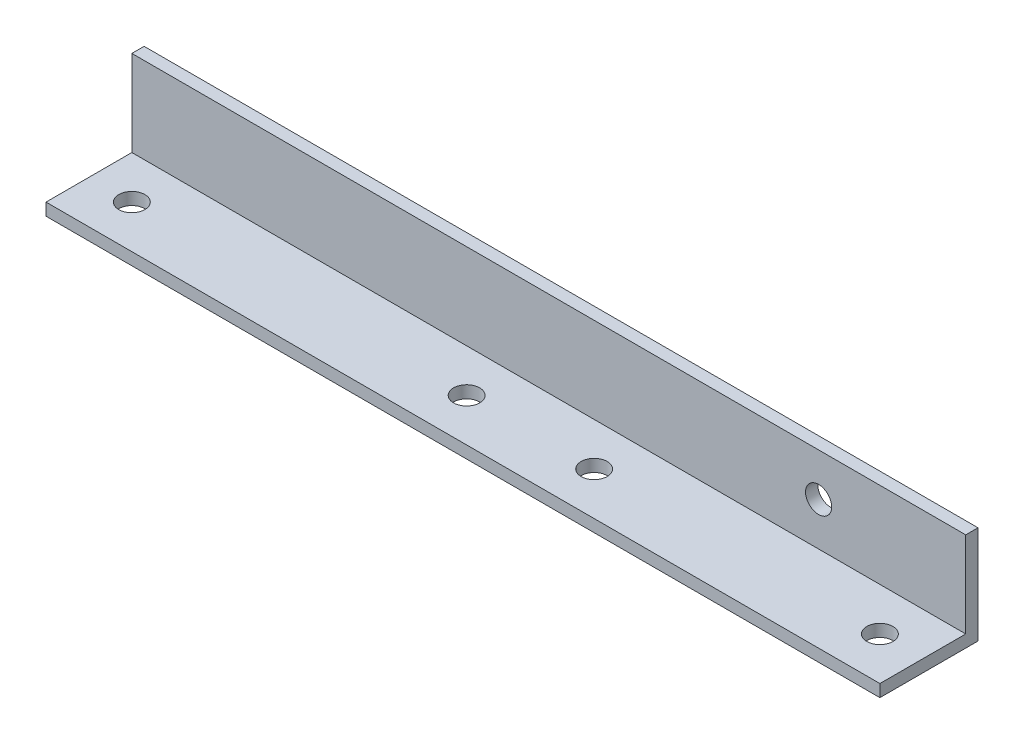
from build123d import *

# Parameters (mm, degrees)
SKETCH1_W           = 215.9
SKETCH1_H           = 25.4
BOSS_EXTRUDE1_DEPTH = 3.175
SKETCH2_W           = 215.9
SKETCH2_H           = 3.175
BOSS_EXTRUDE2_DEPTH = 22.225
SKETCH3_R           = 3.3782
CUT_EXTRUDE1_DEPTH  = 111.943423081
SKETCH4_R           = 3.3782
CUT_EXTRUDE2_DEPTH  = 114.103108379


with BuildPart() as part:
    # Sketch1 → Boss-Extrude1 (new body)
    with BuildSketch(Plane(origin=(0, 0, 0), x_dir=(1, 0, 0), z_dir=(0, 1, 0))):
        Rectangle(SKETCH1_W, SKETCH1_H)
    extrude(amount=BOSS_EXTRUDE1_DEPTH)

    # Sketch2 → Boss-Extrude2 (add)
    with BuildSketch(Plane(origin=(0, 3.175, 0), x_dir=(1, 0, 0), z_dir=(0, 1, 0))):
        with Locations((0, 11.1125)):
            Rectangle(SKETCH2_W, SKETCH2_H)
    extrude(amount=BOSS_EXTRUDE2_DEPTH)

    # Sketch3 → Cut-Extrude1 (cut, through all)
    with BuildSketch(Plane(origin=(0, 3.175, 0), x_dir=(1, 0, 0), z_dir=(0, 1, 0))):
        with Locations(Location((-96.8375, -1.5875, 0), (0, 0, 270))):
            Circle(SKETCH3_R)
        with Locations(Location((-10.16, -1.5875, 0), (0, 0, 270))):
            Circle(SKETCH3_R)
        with Locations(Location((96.8375, -1.5875, 0), (0, 0, 270))):
            Circle(SKETCH3_R)
        with Locations(Location((22.86, -1.5875, 0), (0, 0, 270))):
            Circle(SKETCH3_R)
    extrude(amount=-CUT_EXTRUDE1_DEPTH, mode=Mode.SUBTRACT)

    # Sketch4 → Cut-Extrude2 (cut, through all)
    with BuildSketch(Plane.XY.offset(-9.525)):
        with Locations((69.85, 14.2875)):
            Circle(SKETCH4_R)
    extrude(amount=-CUT_EXTRUDE2_DEPTH, mode=Mode.SUBTRACT)


solid = part.part
